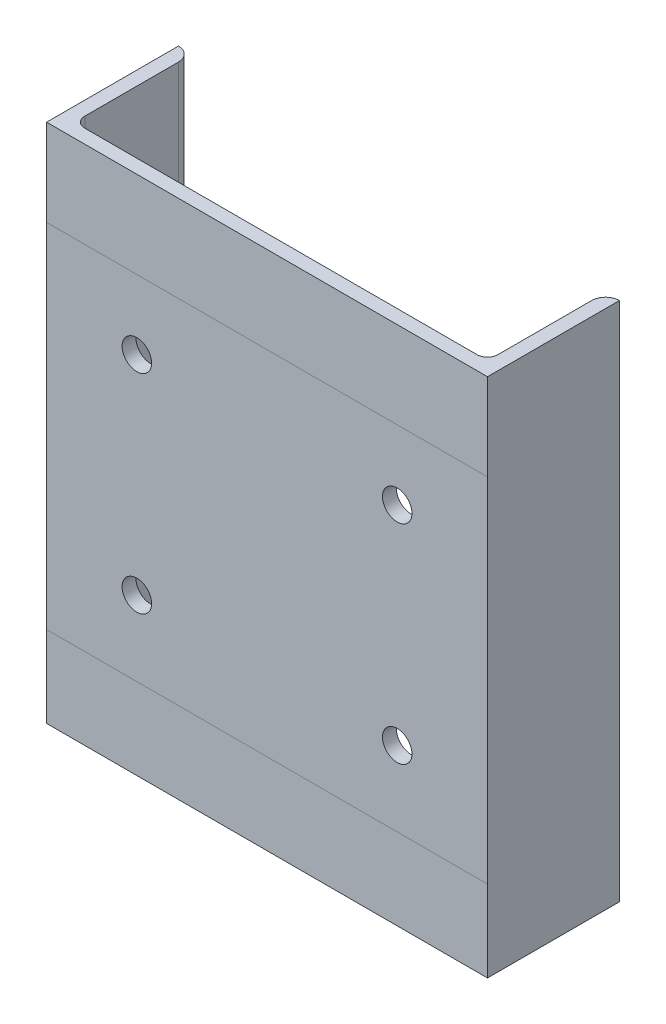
ISO-10303-21;
HEADER;
FILE_DESCRIPTION(('STEP AP214'),'2;1');
FILE_NAME('part.step','',(''),(''),'','','');
FILE_SCHEMA(('AUTOMOTIVE_DESIGN { 1 0 10303 214 1 1 1 1 }'));
ENDSEC;
DATA;
#1=APPLICATION_CONTEXT('core data for automotive mechanical design processes');
#2=APPLICATION_PROTOCOL_DEFINITION('international standard','automotive_design',2000,#1);
#3=PRODUCT_CONTEXT('',#1,'mechanical');
#4=PRODUCT('Part','Part','',(#3));
#5=PRODUCT_RELATED_PRODUCT_CATEGORY('part','',(#4));
#6=PRODUCT_DEFINITION_FORMATION('','',#4);
#7=PRODUCT_DEFINITION_CONTEXT('part definition',#1,'design');
#8=PRODUCT_DEFINITION('design','',#6,#7);
#9=PRODUCT_DEFINITION_SHAPE('','',#8);
#10=(LENGTH_UNIT() NAMED_UNIT(*) SI_UNIT(.MILLI.,.METRE.));
#11=(NAMED_UNIT(*) PLANE_ANGLE_UNIT() SI_UNIT($,.RADIAN.));
#12=(NAMED_UNIT(*) SI_UNIT($,.STERADIAN.) SOLID_ANGLE_UNIT());
#13=UNCERTAINTY_MEASURE_WITH_UNIT(LENGTH_MEASURE(1.E-05),#10,'distance_accuracy_value','');
#14=(GEOMETRIC_REPRESENTATION_CONTEXT(3) GLOBAL_UNCERTAINTY_ASSIGNED_CONTEXT((#13)) GLOBAL_UNIT_ASSIGNED_CONTEXT((#10,
#11,#12)) REPRESENTATION_CONTEXT('',''));
#15=CARTESIAN_POINT('',(0.,0.,0.));
#16=DIRECTION('',(0.,0.,1.));
#17=DIRECTION('',(1.,0.,0.));
#18=AXIS2_PLACEMENT_3D('',#15,#16,#17);
#19=CARTESIAN_POINT('',(-127.,150.,0.));
#20=DIRECTION('',(0.,0.,-1.));
#21=DIRECTION('',(-1.,0.,0.));
#22=AXIS2_PLACEMENT_3D('',#19,#20,#21);
#23=PLANE('',#22);
#24=DIRECTION('',(-1.,0.,0.));
#25=VECTOR('',#24,1.);
#26=CARTESIAN_POINT('',(-127.,100.,0.));
#27=LINE('',#26,#25);
#28=CARTESIAN_POINT('',(127.,100.,0.));
#29=VERTEX_POINT('',#28);
#30=CARTESIAN_POINT('',(-127.,100.,0.));
#31=VERTEX_POINT('',#30);
#32=EDGE_CURVE('E11',#29,#31,#27,.T.);
#33=ORIENTED_EDGE('',*,*,#32,.F.);
#34=DIRECTION('',(0.,-1.,0.));
#35=VECTOR('',#34,1.);
#36=CARTESIAN_POINT('',(127.,150.,0.));
#37=LINE('',#36,#35);
#38=CARTESIAN_POINT('',(127.,150.,0.));
#39=VERTEX_POINT('',#38);
#40=EDGE_CURVE('E126',#39,#29,#37,.T.);
#41=ORIENTED_EDGE('',*,*,#40,.F.);
#42=DIRECTION('',(1.,0.,0.));
#43=VECTOR('',#42,1.);
#44=CARTESIAN_POINT('',(-127.,150.,0.));
#45=LINE('',#44,#43);
#46=CARTESIAN_POINT('',(-127.,150.,0.));
#47=VERTEX_POINT('',#46);
#48=EDGE_CURVE('E121',#47,#39,#45,.T.);
#49=ORIENTED_EDGE('',*,*,#48,.F.);
#50=DIRECTION('',(0.,-1.,0.));
#51=VECTOR('',#50,1.);
#52=CARTESIAN_POINT('',(-127.,150.,0.));
#53=LINE('',#52,#51);
#54=EDGE_CURVE('E124',#47,#31,#53,.T.);
#55=ORIENTED_EDGE('',*,*,#54,.T.);
#56=EDGE_LOOP('',(#33,#41,#49,#55));
#57=FACE_BOUND('',#56,.T.);
#58=ADVANCED_FACE('F33',(#57),#23,.F.);
#59=DIRECTION('',(1.,0.,0.));
#60=VECTOR('',#59,1.);
#61=CARTESIAN_POINT('',(-127.,-103.126399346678,0.));
#62=LINE('',#61,#60);
#63=CARTESIAN_POINT('',(-127.,-103.126399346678,0.));
#64=VERTEX_POINT('',#63);
#65=CARTESIAN_POINT('',(127.,-103.126399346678,0.));
#66=VERTEX_POINT('',#65);
#67=EDGE_CURVE('E42',#64,#66,#62,.T.);
#68=ORIENTED_EDGE('',*,*,#67,.F.);
#69=CARTESIAN_POINT('',(-127.,-150.,0.));
#70=VERTEX_POINT('',#69);
#71=EDGE_CURVE('E144',#64,#70,#53,.T.);
#72=ORIENTED_EDGE('',*,*,#71,.T.);
#73=DIRECTION('',(1.,0.,0.));
#74=VECTOR('',#73,1.);
#75=CARTESIAN_POINT('',(-127.,-150.,0.));
#76=LINE('',#75,#74);
#77=CARTESIAN_POINT('',(127.,-150.,0.));
#78=VERTEX_POINT('',#77);
#79=EDGE_CURVE('E196',#70,#78,#76,.T.);
#80=ORIENTED_EDGE('',*,*,#79,.T.);
#81=EDGE_CURVE('E150',#66,#78,#37,.T.);
#82=ORIENTED_EDGE('',*,*,#81,.F.);
#83=EDGE_LOOP('',(#68,#72,#80,#82));
#84=FACE_BOUND('',#83,.T.);
#85=ADVANCED_FACE('F246',(#84),#23,.F.);
#86=CARTESIAN_POINT('',(-127.,150.,0.));
#87=DIRECTION('',(1.,0.,0.));
#88=DIRECTION('',(0.,0.,-1.));
#89=AXIS2_PLACEMENT_3D('',#86,#87,#88);
#90=PLANE('',#89);
#91=DIRECTION('',(0.,0.,1.));
#92=VECTOR('',#91,1.);
#93=CARTESIAN_POINT('',(-127.,-150.,0.));
#94=LINE('',#93,#92);
#95=CARTESIAN_POINT('',(-127.,-150.,-76.));
#96=VERTEX_POINT('',#95);
#97=EDGE_CURVE('E198',#96,#70,#94,.T.);
#98=ORIENTED_EDGE('',*,*,#97,.T.);
#99=ORIENTED_EDGE('',*,*,#71,.F.);
#100=EDGE_CURVE('E142',#31,#64,#53,.T.);
#101=ORIENTED_EDGE('',*,*,#100,.F.);
#102=ORIENTED_EDGE('',*,*,#54,.F.);
#103=DIRECTION('',(0.,0.,1.));
#104=VECTOR('',#103,1.);
#105=CARTESIAN_POINT('',(-127.,150.,0.));
#106=LINE('',#105,#104);
#107=CARTESIAN_POINT('',(-127.,150.,-76.));
#108=VERTEX_POINT('',#107);
#109=EDGE_CURVE('E130',#108,#47,#106,.T.);
#110=ORIENTED_EDGE('',*,*,#109,.F.);
#111=DIRECTION('',(0.,-1.,0.));
#112=VECTOR('',#111,1.);
#113=CARTESIAN_POINT('',(-127.,150.,-76.));
#114=LINE('',#113,#112);
#115=EDGE_CURVE('E179',#108,#96,#114,.T.);
#116=ORIENTED_EDGE('',*,*,#115,.T.);
#117=EDGE_LOOP('',(#98,#99,#101,#102,#110,#116));
#118=FACE_BOUND('',#117,.T.);
#119=ADVANCED_FACE('F35',(#118),#90,.F.);
#120=CARTESIAN_POINT('',(75.,-60.,0.));
#121=DIRECTION('',(0.,0.,1.));
#122=DIRECTION('',(1.,0.,0.));
#123=AXIS2_PLACEMENT_3D('',#120,#121,#122);
#124=CIRCLE('',#123,8.50000000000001);
#125=CARTESIAN_POINT('',(83.5,-60.,0.));
#126=VERTEX_POINT('',#125);
#127=EDGE_CURVE('E235',#126,#126,#124,.T.);
#128=ORIENTED_EDGE('',*,*,#127,.F.);
#129=EDGE_LOOP('',(#128));
#130=FACE_BOUND('',#129,.T.);
#131=CARTESIAN_POINT('',(-75.,-60.,0.));
#132=DIRECTION('',(0.,0.,1.));
#133=DIRECTION('',(1.,0.,0.));
#134=AXIS2_PLACEMENT_3D('',#131,#132,#133);
#135=CIRCLE('',#134,8.5);
#136=CARTESIAN_POINT('',(-66.5,-60.,0.));
#137=VERTEX_POINT('',#136);
#138=EDGE_CURVE('E229',#137,#137,#135,.T.);
#139=ORIENTED_EDGE('',*,*,#138,.F.);
#140=EDGE_LOOP('',(#139));
#141=FACE_BOUND('',#140,.T.);
#142=CARTESIAN_POINT('',(-75.,60.,0.));
#143=DIRECTION('',(0.,0.,1.));
#144=DIRECTION('',(1.,0.,0.));
#145=AXIS2_PLACEMENT_3D('',#142,#143,#144);
#146=CIRCLE('',#145,8.5);
#147=CARTESIAN_POINT('',(-66.5,60.,0.));
#148=VERTEX_POINT('',#147);
#149=EDGE_CURVE('E223',#148,#148,#146,.T.);
#150=ORIENTED_EDGE('',*,*,#149,.F.);
#151=EDGE_LOOP('',(#150));
#152=FACE_BOUND('',#151,.T.);
#153=CARTESIAN_POINT('',(75.,60.,0.));
#154=DIRECTION('',(0.,0.,1.));
#155=DIRECTION('',(1.,0.,0.));
#156=AXIS2_PLACEMENT_3D('',#153,#154,#155);
#157=CIRCLE('',#156,8.50000000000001);
#158=CARTESIAN_POINT('',(83.5,60.,0.));
#159=VERTEX_POINT('',#158);
#160=EDGE_CURVE('E217',#159,#159,#157,.T.);
#161=ORIENTED_EDGE('',*,*,#160,.F.);
#162=EDGE_LOOP('',(#161));
#163=FACE_BOUND('',#162,.T.);
#164=EDGE_CURVE('E149',#29,#66,#37,.T.);
#165=ORIENTED_EDGE('',*,*,#164,.F.);
#166=ORIENTED_EDGE('',*,*,#32,.T.);
#167=ORIENTED_EDGE('',*,*,#100,.T.);
#168=ORIENTED_EDGE('',*,*,#67,.T.);
#169=EDGE_LOOP('',(#165,#166,#167,#168));
#170=FACE_BOUND('',#169,.T.);
#171=ADVANCED_FACE('F242',(#130,#141,#152,#163,#170),#23,.F.);
#172=CARTESIAN_POINT('',(127.,150.,0.));
#173=DIRECTION('',(-1.,0.,0.));
#174=DIRECTION('',(0.,0.,1.));
#175=AXIS2_PLACEMENT_3D('',#172,#173,#174);
#176=PLANE('',#175);
#177=DIRECTION('',(0.,0.,-1.));
#178=VECTOR('',#177,1.);
#179=CARTESIAN_POINT('',(127.,-150.,0.));
#180=LINE('',#179,#178);
#181=CARTESIAN_POINT('',(127.,-150.,-76.));
#182=VERTEX_POINT('',#181);
#183=EDGE_CURVE('E194',#78,#182,#180,.T.);
#184=ORIENTED_EDGE('',*,*,#183,.T.);
#185=DIRECTION('',(0.,-1.,0.));
#186=VECTOR('',#185,1.);
#187=CARTESIAN_POINT('',(127.,150.,-76.));
#188=LINE('',#187,#186);
#189=CARTESIAN_POINT('',(127.,150.,-76.));
#190=VERTEX_POINT('',#189);
#191=EDGE_CURVE('E154',#190,#182,#188,.T.);
#192=ORIENTED_EDGE('',*,*,#191,.F.);
#193=DIRECTION('',(0.,0.,-1.));
#194=VECTOR('',#193,1.);
#195=CARTESIAN_POINT('',(127.,150.,0.));
#196=LINE('',#195,#194);
#197=EDGE_CURVE('E129',#39,#190,#196,.T.);
#198=ORIENTED_EDGE('',*,*,#197,.F.);
#199=ORIENTED_EDGE('',*,*,#40,.T.);
#200=ORIENTED_EDGE('',*,*,#164,.T.);
#201=ORIENTED_EDGE('',*,*,#81,.T.);
#202=EDGE_LOOP('',(#184,#192,#198,#199,#200,#201));
#203=FACE_BOUND('',#202,.T.);
#204=ADVANCED_FACE('F245',(#203),#176,.F.);
#205=CARTESIAN_POINT('',(127.,150.,-68.));
#206=DIRECTION('',(0.,-1.,0.));
#207=DIRECTION('',(0.,0.,-1.));
#208=AXIS2_PLACEMENT_3D('',#205,#206,#207);
#209=CYLINDRICAL_SURFACE('',#208,8.);
#210=CARTESIAN_POINT('',(127.,-150.,-68.));
#211=DIRECTION('',(0.,1.,0.));
#212=DIRECTION('',(0.,0.,-1.));
#213=AXIS2_PLACEMENT_3D('',#210,#211,#212);
#214=CIRCLE('',#213,8.);
#215=CARTESIAN_POINT('',(119.,-150.,-68.));
#216=VERTEX_POINT('',#215);
#217=EDGE_CURVE('E192',#182,#216,#214,.T.);
#218=ORIENTED_EDGE('',*,*,#217,.T.);
#219=DIRECTION('',(0.,-1.,0.));
#220=VECTOR('',#219,1.);
#221=CARTESIAN_POINT('',(119.,150.,-68.));
#222=LINE('',#221,#220);
#223=CARTESIAN_POINT('',(119.,150.,-68.));
#224=VERTEX_POINT('',#223);
#225=EDGE_CURVE('E156',#224,#216,#222,.T.);
#226=ORIENTED_EDGE('',*,*,#225,.F.);
#227=CARTESIAN_POINT('',(127.,150.,-68.));
#228=DIRECTION('',(0.,1.,0.));
#229=DIRECTION('',(0.,0.,-1.));
#230=AXIS2_PLACEMENT_3D('',#227,#228,#229);
#231=CIRCLE('',#230,8.);
#232=EDGE_CURVE('E212',#190,#224,#231,.T.);
#233=ORIENTED_EDGE('',*,*,#232,.F.);
#234=ORIENTED_EDGE('',*,*,#191,.T.);
#235=EDGE_LOOP('',(#218,#226,#233,#234));
#236=FACE_BOUND('',#235,.T.);
#237=ADVANCED_FACE('F254',(#236),#209,.T.);
#238=CARTESIAN_POINT('',(119.,150.,-14.));
#239=DIRECTION('',(1.,0.,0.));
#240=DIRECTION('',(0.,0.,-1.));
#241=AXIS2_PLACEMENT_3D('',#238,#239,#240);
#242=PLANE('',#241);
#243=DIRECTION('',(0.,0.,1.));
#244=VECTOR('',#243,1.);
#245=CARTESIAN_POINT('',(119.,-150.,-14.));
#246=LINE('',#245,#244);
#247=CARTESIAN_POINT('',(119.,-150.,-14.));
#248=VERTEX_POINT('',#247);
#249=EDGE_CURVE('E190',#216,#248,#246,.T.);
#250=ORIENTED_EDGE('',*,*,#249,.T.);
#251=DIRECTION('',(0.,-1.,0.));
#252=VECTOR('',#251,1.);
#253=CARTESIAN_POINT('',(119.,150.,-14.));
#254=LINE('',#253,#252);
#255=CARTESIAN_POINT('',(119.,150.,-14.));
#256=VERTEX_POINT('',#255);
#257=EDGE_CURVE('E162',#256,#248,#254,.T.);
#258=ORIENTED_EDGE('',*,*,#257,.F.);
#259=DIRECTION('',(0.,0.,1.));
#260=VECTOR('',#259,1.);
#261=CARTESIAN_POINT('',(119.,150.,-14.));
#262=LINE('',#261,#260);
#263=EDGE_CURVE('E210',#224,#256,#262,.T.);
#264=ORIENTED_EDGE('',*,*,#263,.F.);
#265=ORIENTED_EDGE('',*,*,#225,.T.);
#266=EDGE_LOOP('',(#250,#258,#264,#265));
#267=FACE_BOUND('',#266,.T.);
#268=ADVANCED_FACE('F259',(#267),#242,.F.);
#269=CARTESIAN_POINT('',(113.,150.,-14.));
#270=DIRECTION('',(0.,-1.,0.));
#271=DIRECTION('',(0.,0.,-1.));
#272=AXIS2_PLACEMENT_3D('',#269,#270,#271);
#273=CYLINDRICAL_SURFACE('',#272,6.);
#274=CARTESIAN_POINT('',(113.,-150.,-14.));
#275=DIRECTION('',(0.,-1.,0.));
#276=DIRECTION('',(0.,0.,1.));
#277=AXIS2_PLACEMENT_3D('',#274,#275,#276);
#278=CIRCLE('',#277,6.);
#279=CARTESIAN_POINT('',(113.,-150.,-8.));
#280=VERTEX_POINT('',#279);
#281=EDGE_CURVE('E188',#248,#280,#278,.T.);
#282=ORIENTED_EDGE('',*,*,#281,.T.);
#283=DIRECTION('',(0.,-1.,0.));
#284=VECTOR('',#283,1.);
#285=CARTESIAN_POINT('',(113.,150.,-8.));
#286=LINE('',#285,#284);
#287=CARTESIAN_POINT('',(113.,150.,-8.));
#288=VERTEX_POINT('',#287);
#289=EDGE_CURVE('E167',#288,#280,#286,.T.);
#290=ORIENTED_EDGE('',*,*,#289,.F.);
#291=CARTESIAN_POINT('',(113.,150.,-14.));
#292=DIRECTION('',(0.,-1.,0.));
#293=DIRECTION('',(0.,0.,1.));
#294=AXIS2_PLACEMENT_3D('',#291,#292,#293);
#295=CIRCLE('',#294,6.);
#296=EDGE_CURVE('E208',#256,#288,#295,.T.);
#297=ORIENTED_EDGE('',*,*,#296,.F.);
#298=ORIENTED_EDGE('',*,*,#257,.T.);
#299=EDGE_LOOP('',(#282,#290,#297,#298));
#300=FACE_BOUND('',#299,.T.);
#301=ADVANCED_FACE('F296',(#300),#273,.F.);
#302=CARTESIAN_POINT('',(-113.,150.,-8.));
#303=DIRECTION('',(0.,0.,1.));
#304=DIRECTION('',(1.,0.,0.));
#305=AXIS2_PLACEMENT_3D('',#302,#303,#304);
#306=PLANE('',#305);
#307=CARTESIAN_POINT('',(75.,-60.,-8.00000000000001));
#308=DIRECTION('',(0.,0.,1.));
#309=DIRECTION('',(1.,0.,0.));
#310=AXIS2_PLACEMENT_3D('',#307,#308,#309);
#311=CIRCLE('',#310,8.50000000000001);
#312=CARTESIAN_POINT('',(83.5,-60.,-8.00000000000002));
#313=VERTEX_POINT('',#312);
#314=EDGE_CURVE('E232',#313,#313,#311,.F.);
#315=ORIENTED_EDGE('',*,*,#314,.F.);
#316=EDGE_LOOP('',(#315));
#317=FACE_BOUND('',#316,.T.);
#318=CARTESIAN_POINT('',(-75.,-60.,-8.00000000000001));
#319=DIRECTION('',(0.,0.,1.));
#320=DIRECTION('',(1.,0.,0.));
#321=AXIS2_PLACEMENT_3D('',#318,#319,#320);
#322=CIRCLE('',#321,8.5);
#323=CARTESIAN_POINT('',(-66.5,-60.,-8.00000000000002));
#324=VERTEX_POINT('',#323);
#325=EDGE_CURVE('E226',#324,#324,#322,.F.);
#326=ORIENTED_EDGE('',*,*,#325,.F.);
#327=EDGE_LOOP('',(#326));
#328=FACE_BOUND('',#327,.T.);
#329=CARTESIAN_POINT('',(-75.,60.,-8.00000000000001));
#330=DIRECTION('',(0.,0.,1.));
#331=DIRECTION('',(1.,0.,0.));
#332=AXIS2_PLACEMENT_3D('',#329,#330,#331);
#333=CIRCLE('',#332,8.5);
#334=CARTESIAN_POINT('',(-66.5,60.,-8.00000000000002));
#335=VERTEX_POINT('',#334);
#336=EDGE_CURVE('E220',#335,#335,#333,.F.);
#337=ORIENTED_EDGE('',*,*,#336,.F.);
#338=EDGE_LOOP('',(#337));
#339=FACE_BOUND('',#338,.T.);
#340=CARTESIAN_POINT('',(75.,60.,-8.00000000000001));
#341=DIRECTION('',(0.,0.,1.));
#342=DIRECTION('',(1.,0.,0.));
#343=AXIS2_PLACEMENT_3D('',#340,#341,#342);
#344=CIRCLE('',#343,8.50000000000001);
#345=CARTESIAN_POINT('',(83.5,60.,-8.00000000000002));
#346=VERTEX_POINT('',#345);
#347=EDGE_CURVE('E200',#346,#346,#344,.F.);
#348=ORIENTED_EDGE('',*,*,#347,.F.);
#349=EDGE_LOOP('',(#348));
#350=FACE_BOUND('',#349,.T.);
#351=DIRECTION('',(-1.,0.,0.));
#352=VECTOR('',#351,1.);
#353=CARTESIAN_POINT('',(-113.,-150.,-8.));
#354=LINE('',#353,#352);
#355=CARTESIAN_POINT('',(-113.,-150.,-8.));
#356=VERTEX_POINT('',#355);
#357=EDGE_CURVE('E186',#280,#356,#354,.T.);
#358=ORIENTED_EDGE('',*,*,#357,.T.);
#359=DIRECTION('',(0.,-1.,0.));
#360=VECTOR('',#359,1.);
#361=CARTESIAN_POINT('',(-113.,150.,-8.));
#362=LINE('',#361,#360);
#363=CARTESIAN_POINT('',(-113.,150.,-8.));
#364=VERTEX_POINT('',#363);
#365=EDGE_CURVE('E170',#364,#356,#362,.T.);
#366=ORIENTED_EDGE('',*,*,#365,.F.);
#367=DIRECTION('',(-1.,0.,0.));
#368=VECTOR('',#367,1.);
#369=CARTESIAN_POINT('',(-113.,150.,-8.));
#370=LINE('',#369,#368);
#371=EDGE_CURVE('E206',#288,#364,#370,.T.);
#372=ORIENTED_EDGE('',*,*,#371,.F.);
#373=ORIENTED_EDGE('',*,*,#289,.T.);
#374=EDGE_LOOP('',(#358,#366,#372,#373));
#375=FACE_BOUND('',#374,.T.);
#376=ADVANCED_FACE('F305',(#317,#328,#339,#350,#375),#306,.F.);
#377=CARTESIAN_POINT('',(-113.,150.,-14.));
#378=DIRECTION('',(0.,-1.,0.));
#379=DIRECTION('',(0.,0.,-1.));
#380=AXIS2_PLACEMENT_3D('',#377,#378,#379);
#381=CYLINDRICAL_SURFACE('',#380,6.);
#382=CARTESIAN_POINT('',(-113.,-150.,-14.));
#383=DIRECTION('',(0.,-1.,0.));
#384=DIRECTION('',(0.,0.,-1.));
#385=AXIS2_PLACEMENT_3D('',#382,#383,#384);
#386=CIRCLE('',#385,6.);
#387=CARTESIAN_POINT('',(-119.,-150.,-14.));
#388=VERTEX_POINT('',#387);
#389=EDGE_CURVE('E184',#356,#388,#386,.T.);
#390=ORIENTED_EDGE('',*,*,#389,.T.);
#391=DIRECTION('',(0.,-1.,0.));
#392=VECTOR('',#391,1.);
#393=CARTESIAN_POINT('',(-119.,150.,-14.));
#394=LINE('',#393,#392);
#395=CARTESIAN_POINT('',(-119.,150.,-14.));
#396=VERTEX_POINT('',#395);
#397=EDGE_CURVE('E173',#396,#388,#394,.T.);
#398=ORIENTED_EDGE('',*,*,#397,.F.);
#399=CARTESIAN_POINT('',(-113.,150.,-14.));
#400=DIRECTION('',(0.,-1.,0.));
#401=DIRECTION('',(0.,0.,-1.));
#402=AXIS2_PLACEMENT_3D('',#399,#400,#401);
#403=CIRCLE('',#402,6.);
#404=EDGE_CURVE('E204',#364,#396,#403,.T.);
#405=ORIENTED_EDGE('',*,*,#404,.F.);
#406=ORIENTED_EDGE('',*,*,#365,.T.);
#407=EDGE_LOOP('',(#390,#398,#405,#406));
#408=FACE_BOUND('',#407,.T.);
#409=ADVANCED_FACE('F315',(#408),#381,.F.);
#410=CARTESIAN_POINT('',(-119.,150.,-14.));
#411=DIRECTION('',(-1.,0.,0.));
#412=DIRECTION('',(0.,0.,1.));
#413=AXIS2_PLACEMENT_3D('',#410,#411,#412);
#414=PLANE('',#413);
#415=DIRECTION('',(0.,0.,-1.));
#416=VECTOR('',#415,1.);
#417=CARTESIAN_POINT('',(-119.,-150.,-14.));
#418=LINE('',#417,#416);
#419=CARTESIAN_POINT('',(-119.,-150.,-68.));
#420=VERTEX_POINT('',#419);
#421=EDGE_CURVE('E182',#388,#420,#418,.T.);
#422=ORIENTED_EDGE('',*,*,#421,.T.);
#423=DIRECTION('',(0.,-1.,0.));
#424=VECTOR('',#423,1.);
#425=CARTESIAN_POINT('',(-119.,150.,-68.));
#426=LINE('',#425,#424);
#427=CARTESIAN_POINT('',(-119.,150.,-68.));
#428=VERTEX_POINT('',#427);
#429=EDGE_CURVE('E176',#428,#420,#426,.T.);
#430=ORIENTED_EDGE('',*,*,#429,.F.);
#431=DIRECTION('',(0.,0.,-1.));
#432=VECTOR('',#431,1.);
#433=CARTESIAN_POINT('',(-119.,150.,-14.));
#434=LINE('',#433,#432);
#435=EDGE_CURVE('E202',#396,#428,#434,.T.);
#436=ORIENTED_EDGE('',*,*,#435,.F.);
#437=ORIENTED_EDGE('',*,*,#397,.T.);
#438=EDGE_LOOP('',(#422,#430,#436,#437));
#439=FACE_BOUND('',#438,.T.);
#440=ADVANCED_FACE('F325',(#439),#414,.F.);
#441=CARTESIAN_POINT('',(-127.,150.,-68.));
#442=DIRECTION('',(0.,-1.,0.));
#443=DIRECTION('',(0.,0.,-1.));
#444=AXIS2_PLACEMENT_3D('',#441,#442,#443);
#445=CYLINDRICAL_SURFACE('',#444,8.);
#446=CARTESIAN_POINT('',(-127.,-150.,-68.));
#447=DIRECTION('',(0.,1.,0.));
#448=DIRECTION('',(0.,0.,1.));
#449=AXIS2_PLACEMENT_3D('',#446,#447,#448);
#450=CIRCLE('',#449,8.);
#451=EDGE_CURVE('E139',#420,#96,#450,.T.);
#452=ORIENTED_EDGE('',*,*,#451,.T.);
#453=ORIENTED_EDGE('',*,*,#115,.F.);
#454=CARTESIAN_POINT('',(-127.,150.,-68.));
#455=DIRECTION('',(0.,1.,0.));
#456=DIRECTION('',(0.,0.,1.));
#457=AXIS2_PLACEMENT_3D('',#454,#455,#456);
#458=CIRCLE('',#457,8.);
#459=EDGE_CURVE('E135',#428,#108,#458,.T.);
#460=ORIENTED_EDGE('',*,*,#459,.F.);
#461=ORIENTED_EDGE('',*,*,#429,.T.);
#462=EDGE_LOOP('',(#452,#453,#460,#461));
#463=FACE_BOUND('',#462,.T.);
#464=ADVANCED_FACE('F334',(#463),#445,.T.);
#465=CARTESIAN_POINT('',(-127.,150.,-68.));
#466=DIRECTION('',(0.,1.,0.));
#467=DIRECTION('',(0.,0.,1.));
#468=AXIS2_PLACEMENT_3D('',#465,#466,#467);
#469=PLANE('',#468);
#470=ORIENTED_EDGE('',*,*,#109,.T.);
#471=ORIENTED_EDGE('',*,*,#48,.T.);
#472=ORIENTED_EDGE('',*,*,#197,.T.);
#473=ORIENTED_EDGE('',*,*,#232,.T.);
#474=ORIENTED_EDGE('',*,*,#263,.T.);
#475=ORIENTED_EDGE('',*,*,#296,.T.);
#476=ORIENTED_EDGE('',*,*,#371,.T.);
#477=ORIENTED_EDGE('',*,*,#404,.T.);
#478=ORIENTED_EDGE('',*,*,#435,.T.);
#479=ORIENTED_EDGE('',*,*,#459,.T.);
#480=EDGE_LOOP('',(#470,#471,#472,#473,#474,#475,#476,#477,#478,#479));
#481=FACE_BOUND('',#480,.T.);
#482=ADVANCED_FACE('F133',(#481),#469,.T.);
#483=CARTESIAN_POINT('',(-127.,-150.,-68.));
#484=DIRECTION('',(0.,1.,0.));
#485=DIRECTION('',(0.,0.,1.));
#486=AXIS2_PLACEMENT_3D('',#483,#484,#485);
#487=PLANE('',#486);
#488=ORIENTED_EDGE('',*,*,#97,.F.);
#489=ORIENTED_EDGE('',*,*,#451,.F.);
#490=ORIENTED_EDGE('',*,*,#421,.F.);
#491=ORIENTED_EDGE('',*,*,#389,.F.);
#492=ORIENTED_EDGE('',*,*,#357,.F.);
#493=ORIENTED_EDGE('',*,*,#281,.F.);
#494=ORIENTED_EDGE('',*,*,#249,.F.);
#495=ORIENTED_EDGE('',*,*,#217,.F.);
#496=ORIENTED_EDGE('',*,*,#183,.F.);
#497=ORIENTED_EDGE('',*,*,#79,.F.);
#498=EDGE_LOOP('',(#488,#489,#490,#491,#492,#493,#494,#495,#496,#497));
#499=FACE_BOUND('',#498,.T.);
#500=ADVANCED_FACE('F351',(#499),#487,.F.);
#501=CARTESIAN_POINT('',(75.,60.,-76.001));
#502=DIRECTION('',(0.,0.,1.));
#503=DIRECTION('',(1.,0.,0.));
#504=AXIS2_PLACEMENT_3D('',#501,#502,#503);
#505=CYLINDRICAL_SURFACE('',#504,8.50000000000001);
#506=CARTESIAN_POINT('',(83.5,60.,0.));
#507=CARTESIAN_POINT('',(83.5,60.,-0.0833333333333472));
#508=CARTESIAN_POINT('',(83.5,60.,-0.166666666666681));
#509=CARTESIAN_POINT('',(83.5,60.,-0.333333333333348));
#510=CARTESIAN_POINT('',(83.5,60.,-0.416666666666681));
#511=CARTESIAN_POINT('',(83.5,60.,-0.583333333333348));
#512=CARTESIAN_POINT('',(83.5,60.,-0.666666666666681));
#513=CARTESIAN_POINT('',(83.5,60.,-0.833333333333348));
#514=CARTESIAN_POINT('',(83.5,60.,-0.916666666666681));
#515=CARTESIAN_POINT('',(83.5,60.,-1.08333333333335));
#516=CARTESIAN_POINT('',(83.5,60.,-1.16666666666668));
#517=CARTESIAN_POINT('',(83.5,60.,-1.33333333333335));
#518=CARTESIAN_POINT('',(83.5,60.,-1.41666666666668));
#519=CARTESIAN_POINT('',(83.5,60.,-1.58333333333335));
#520=CARTESIAN_POINT('',(83.5,60.,-1.66666666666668));
#521=CARTESIAN_POINT('',(83.5,60.,-1.83333333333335));
#522=CARTESIAN_POINT('',(83.5,60.,-1.91666666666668));
#523=CARTESIAN_POINT('',(83.5,60.,-2.08333333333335));
#524=CARTESIAN_POINT('',(83.5,60.,-2.16666666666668));
#525=CARTESIAN_POINT('',(83.5,60.,-2.33333333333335));
#526=CARTESIAN_POINT('',(83.5,60.,-2.41666666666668));
#527=CARTESIAN_POINT('',(83.5,60.,-2.58333333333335));
#528=CARTESIAN_POINT('',(83.5,60.,-2.66666666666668));
#529=CARTESIAN_POINT('',(83.5,60.,-2.83333333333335));
#530=CARTESIAN_POINT('',(83.5,60.,-2.91666666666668));
#531=CARTESIAN_POINT('',(83.5,60.,-3.08333333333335));
#532=CARTESIAN_POINT('',(83.5,60.,-3.16666666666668));
#533=CARTESIAN_POINT('',(83.5,60.,-3.33333333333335));
#534=CARTESIAN_POINT('',(83.5,60.,-3.41666666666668));
#535=CARTESIAN_POINT('',(83.5,60.,-3.58333333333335));
#536=CARTESIAN_POINT('',(83.5,60.,-3.66666666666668));
#537=CARTESIAN_POINT('',(83.5,60.,-3.83333333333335));
#538=CARTESIAN_POINT('',(83.5,60.,-3.91666666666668));
#539=CARTESIAN_POINT('',(83.5,60.,-4.08333333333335));
#540=CARTESIAN_POINT('',(83.5,60.,-4.16666666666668));
#541=CARTESIAN_POINT('',(83.5,60.,-4.33333333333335));
#542=CARTESIAN_POINT('',(83.5,60.,-4.41666666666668));
#543=CARTESIAN_POINT('',(83.5,60.,-4.58333333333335));
#544=CARTESIAN_POINT('',(83.5,60.,-4.66666666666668));
#545=CARTESIAN_POINT('',(83.5,60.,-4.83333333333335));
#546=CARTESIAN_POINT('',(83.5,60.,-4.91666666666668));
#547=CARTESIAN_POINT('',(83.5,60.,-5.08333333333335));
#548=CARTESIAN_POINT('',(83.5,60.,-5.16666666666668));
#549=CARTESIAN_POINT('',(83.5,60.,-5.33333333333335));
#550=CARTESIAN_POINT('',(83.5,60.,-5.41666666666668));
#551=CARTESIAN_POINT('',(83.5,60.,-5.58333333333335));
#552=CARTESIAN_POINT('',(83.5,60.,-5.66666666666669));
#553=CARTESIAN_POINT('',(83.5,60.,-5.83333333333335));
#554=CARTESIAN_POINT('',(83.5,60.,-5.91666666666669));
#555=CARTESIAN_POINT('',(83.5,60.,-6.08333333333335));
#556=CARTESIAN_POINT('',(83.5,60.,-6.16666666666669));
#557=CARTESIAN_POINT('',(83.5,60.,-6.33333333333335));
#558=CARTESIAN_POINT('',(83.5,60.,-6.41666666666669));
#559=CARTESIAN_POINT('',(83.5,60.,-6.58333333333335));
#560=CARTESIAN_POINT('',(83.5,60.,-6.66666666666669));
#561=CARTESIAN_POINT('',(83.5,60.,-6.83333333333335));
#562=CARTESIAN_POINT('',(83.5,60.,-6.91666666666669));
#563=CARTESIAN_POINT('',(83.5,60.,-7.08333333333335));
#564=CARTESIAN_POINT('',(83.5,60.,-7.16666666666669));
#565=CARTESIAN_POINT('',(83.5,60.,-7.33333333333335));
#566=CARTESIAN_POINT('',(83.5,60.,-7.41666666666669));
#567=CARTESIAN_POINT('',(83.5,60.,-7.58333333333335));
#568=CARTESIAN_POINT('',(83.5,60.,-7.66666666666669));
#569=CARTESIAN_POINT('',(83.5,60.,-7.83333333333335));
#570=CARTESIAN_POINT('',(83.5,60.,-7.91666666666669));
#571=CARTESIAN_POINT('',(83.5,60.,-8.00000000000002));
#572=B_SPLINE_CURVE_WITH_KNOTS('',3,(#506,#507,#508,#509,#510,#511,#512,#513,#514,#515,#516,
#517,#518,#519,#520,#521,#522,#523,#524,#525,#526,#527,#528,#529,#530,#531,#532,#533,#534,#535,
#536,#537,#538,#539,#540,#541,#542,#543,#544,#545,#546,#547,#548,#549,#550,#551,#552,#553,#554,
#555,#556,#557,#558,#559,#560,#561,#562,#563,#564,#565,#566,#567,#568,#569,#570,#571),
.UNSPECIFIED.,.F.,.F.,(4,2,2,2,2,2,2,2,2,2,2,2,2,2,2,2,2,2,2,2,2,2,2,2,2,2,2,2,2,2,2,2,4),(0.,
0.25,0.5,0.750000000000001,1.,1.25,1.5,1.75,2.,2.25,2.5,2.75,3.,3.25,3.5,3.75,4.,4.25,4.5,4.75,
5.,5.25,5.50000000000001,5.75000000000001,6.00000000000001,6.25000000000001,6.50000000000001,
6.75000000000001,7.00000000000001,7.25000000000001,7.50000000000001,7.75000000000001,
8.00000000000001),.UNSPECIFIED.);
#573=EDGE_CURVE('BSEAM358',#159,#346,#572,.T.);
#574=ORIENTED_EDGE('',*,*,#160,.T.);
#575=ORIENTED_EDGE('',*,*,#347,.T.);
#576=ORIENTED_EDGE('',*,*,#573,.T.);
#577=ORIENTED_EDGE('',*,*,#573,.F.);
#578=EDGE_LOOP('',(#574,#576,#575,#577));
#579=FACE_BOUND('',#578,.T.);
#580=ADVANCED_FACE('F358',(#579),#505,.F.);
#581=CARTESIAN_POINT('',(-75.,60.,-76.001));
#582=DIRECTION('',(0.,0.,1.));
#583=DIRECTION('',(1.,0.,0.));
#584=AXIS2_PLACEMENT_3D('',#581,#582,#583);
#585=CYLINDRICAL_SURFACE('',#584,8.5);
#586=CARTESIAN_POINT('',(-66.5,60.,0.));
#587=CARTESIAN_POINT('',(-66.5,60.,-0.0833333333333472));
#588=CARTESIAN_POINT('',(-66.5,60.,-0.166666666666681));
#589=CARTESIAN_POINT('',(-66.5,60.,-0.333333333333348));
#590=CARTESIAN_POINT('',(-66.5,60.,-0.416666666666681));
#591=CARTESIAN_POINT('',(-66.5,60.,-0.583333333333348));
#592=CARTESIAN_POINT('',(-66.5,60.,-0.666666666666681));
#593=CARTESIAN_POINT('',(-66.5,60.,-0.833333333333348));
#594=CARTESIAN_POINT('',(-66.5,60.,-0.916666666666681));
#595=CARTESIAN_POINT('',(-66.5,60.,-1.08333333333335));
#596=CARTESIAN_POINT('',(-66.5,60.,-1.16666666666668));
#597=CARTESIAN_POINT('',(-66.5,60.,-1.33333333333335));
#598=CARTESIAN_POINT('',(-66.5,60.,-1.41666666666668));
#599=CARTESIAN_POINT('',(-66.5,60.,-1.58333333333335));
#600=CARTESIAN_POINT('',(-66.5,60.,-1.66666666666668));
#601=CARTESIAN_POINT('',(-66.5,60.,-1.83333333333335));
#602=CARTESIAN_POINT('',(-66.5,60.,-1.91666666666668));
#603=CARTESIAN_POINT('',(-66.5,60.,-2.08333333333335));
#604=CARTESIAN_POINT('',(-66.5,60.,-2.16666666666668));
#605=CARTESIAN_POINT('',(-66.5,60.,-2.33333333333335));
#606=CARTESIAN_POINT('',(-66.5,60.,-2.41666666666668));
#607=CARTESIAN_POINT('',(-66.5,60.,-2.58333333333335));
#608=CARTESIAN_POINT('',(-66.5,60.,-2.66666666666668));
#609=CARTESIAN_POINT('',(-66.5,60.,-2.83333333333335));
#610=CARTESIAN_POINT('',(-66.5,60.,-2.91666666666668));
#611=CARTESIAN_POINT('',(-66.5,60.,-3.08333333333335));
#612=CARTESIAN_POINT('',(-66.5,60.,-3.16666666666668));
#613=CARTESIAN_POINT('',(-66.5,60.,-3.33333333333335));
#614=CARTESIAN_POINT('',(-66.5,60.,-3.41666666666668));
#615=CARTESIAN_POINT('',(-66.5,60.,-3.58333333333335));
#616=CARTESIAN_POINT('',(-66.5,60.,-3.66666666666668));
#617=CARTESIAN_POINT('',(-66.5,60.,-3.83333333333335));
#618=CARTESIAN_POINT('',(-66.5,60.,-3.91666666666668));
#619=CARTESIAN_POINT('',(-66.5,60.,-4.08333333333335));
#620=CARTESIAN_POINT('',(-66.5,60.,-4.16666666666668));
#621=CARTESIAN_POINT('',(-66.5,60.,-4.33333333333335));
#622=CARTESIAN_POINT('',(-66.5,60.,-4.41666666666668));
#623=CARTESIAN_POINT('',(-66.5,60.,-4.58333333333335));
#624=CARTESIAN_POINT('',(-66.5,60.,-4.66666666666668));
#625=CARTESIAN_POINT('',(-66.5,60.,-4.83333333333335));
#626=CARTESIAN_POINT('',(-66.5,60.,-4.91666666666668));
#627=CARTESIAN_POINT('',(-66.5,60.,-5.08333333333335));
#628=CARTESIAN_POINT('',(-66.5,60.,-5.16666666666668));
#629=CARTESIAN_POINT('',(-66.5,60.,-5.33333333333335));
#630=CARTESIAN_POINT('',(-66.5,60.,-5.41666666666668));
#631=CARTESIAN_POINT('',(-66.5,60.,-5.58333333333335));
#632=CARTESIAN_POINT('',(-66.5,60.,-5.66666666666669));
#633=CARTESIAN_POINT('',(-66.5,60.,-5.83333333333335));
#634=CARTESIAN_POINT('',(-66.5,60.,-5.91666666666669));
#635=CARTESIAN_POINT('',(-66.5,60.,-6.08333333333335));
#636=CARTESIAN_POINT('',(-66.5,60.,-6.16666666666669));
#637=CARTESIAN_POINT('',(-66.5,60.,-6.33333333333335));
#638=CARTESIAN_POINT('',(-66.5,60.,-6.41666666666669));
#639=CARTESIAN_POINT('',(-66.5,60.,-6.58333333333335));
#640=CARTESIAN_POINT('',(-66.5,60.,-6.66666666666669));
#641=CARTESIAN_POINT('',(-66.5,60.,-6.83333333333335));
#642=CARTESIAN_POINT('',(-66.5,60.,-6.91666666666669));
#643=CARTESIAN_POINT('',(-66.5,60.,-7.08333333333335));
#644=CARTESIAN_POINT('',(-66.5,60.,-7.16666666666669));
#645=CARTESIAN_POINT('',(-66.5,60.,-7.33333333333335));
#646=CARTESIAN_POINT('',(-66.5,60.,-7.41666666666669));
#647=CARTESIAN_POINT('',(-66.5,60.,-7.58333333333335));
#648=CARTESIAN_POINT('',(-66.5,60.,-7.66666666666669));
#649=CARTESIAN_POINT('',(-66.5,60.,-7.83333333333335));
#650=CARTESIAN_POINT('',(-66.5,60.,-7.91666666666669));
#651=CARTESIAN_POINT('',(-66.5,60.,-8.00000000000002));
#652=B_SPLINE_CURVE_WITH_KNOTS('',3,(#586,#587,#588,#589,#590,#591,#592,#593,#594,#595,#596,
#597,#598,#599,#600,#601,#602,#603,#604,#605,#606,#607,#608,#609,#610,#611,#612,#613,#614,#615,
#616,#617,#618,#619,#620,#621,#622,#623,#624,#625,#626,#627,#628,#629,#630,#631,#632,#633,#634,
#635,#636,#637,#638,#639,#640,#641,#642,#643,#644,#645,#646,#647,#648,#649,#650,#651),
.UNSPECIFIED.,.F.,.F.,(4,2,2,2,2,2,2,2,2,2,2,2,2,2,2,2,2,2,2,2,2,2,2,2,2,2,2,2,2,2,2,2,4),(0.,
0.25,0.5,0.750000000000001,1.,1.25,1.5,1.75,2.,2.25,2.5,2.75,3.,3.25,3.5,3.75,4.,4.25,4.5,4.75,
5.,5.25,5.50000000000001,5.75000000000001,6.00000000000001,6.25000000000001,6.50000000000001,
6.75000000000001,7.00000000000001,7.25000000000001,7.50000000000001,7.75000000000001,
8.00000000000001),.UNSPECIFIED.);
#653=EDGE_CURVE('BSEAM366',#148,#335,#652,.T.);
#654=ORIENTED_EDGE('',*,*,#149,.T.);
#655=ORIENTED_EDGE('',*,*,#336,.T.);
#656=ORIENTED_EDGE('',*,*,#653,.T.);
#657=ORIENTED_EDGE('',*,*,#653,.F.);
#658=EDGE_LOOP('',(#654,#656,#655,#657));
#659=FACE_BOUND('',#658,.T.);
#660=ADVANCED_FACE('F366',(#659),#585,.F.);
#661=CARTESIAN_POINT('',(-75.,-60.,-76.001));
#662=DIRECTION('',(0.,0.,1.));
#663=DIRECTION('',(1.,0.,0.));
#664=AXIS2_PLACEMENT_3D('',#661,#662,#663);
#665=CYLINDRICAL_SURFACE('',#664,8.5);
#666=CARTESIAN_POINT('',(-66.5,-60.,0.));
#667=CARTESIAN_POINT('',(-66.5,-60.,-0.0833333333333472));
#668=CARTESIAN_POINT('',(-66.5,-60.,-0.166666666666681));
#669=CARTESIAN_POINT('',(-66.5,-60.,-0.333333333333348));
#670=CARTESIAN_POINT('',(-66.5,-60.,-0.416666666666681));
#671=CARTESIAN_POINT('',(-66.5,-60.,-0.583333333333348));
#672=CARTESIAN_POINT('',(-66.5,-60.,-0.666666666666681));
#673=CARTESIAN_POINT('',(-66.5,-60.,-0.833333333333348));
#674=CARTESIAN_POINT('',(-66.5,-60.,-0.916666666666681));
#675=CARTESIAN_POINT('',(-66.5,-60.,-1.08333333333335));
#676=CARTESIAN_POINT('',(-66.5,-60.,-1.16666666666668));
#677=CARTESIAN_POINT('',(-66.5,-60.,-1.33333333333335));
#678=CARTESIAN_POINT('',(-66.5,-60.,-1.41666666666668));
#679=CARTESIAN_POINT('',(-66.5,-60.,-1.58333333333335));
#680=CARTESIAN_POINT('',(-66.5,-60.,-1.66666666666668));
#681=CARTESIAN_POINT('',(-66.5,-60.,-1.83333333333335));
#682=CARTESIAN_POINT('',(-66.5,-60.,-1.91666666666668));
#683=CARTESIAN_POINT('',(-66.5,-60.,-2.08333333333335));
#684=CARTESIAN_POINT('',(-66.5,-60.,-2.16666666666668));
#685=CARTESIAN_POINT('',(-66.5,-60.,-2.33333333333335));
#686=CARTESIAN_POINT('',(-66.5,-60.,-2.41666666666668));
#687=CARTESIAN_POINT('',(-66.5,-60.,-2.58333333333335));
#688=CARTESIAN_POINT('',(-66.5,-60.,-2.66666666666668));
#689=CARTESIAN_POINT('',(-66.5,-60.,-2.83333333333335));
#690=CARTESIAN_POINT('',(-66.5,-60.,-2.91666666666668));
#691=CARTESIAN_POINT('',(-66.5,-60.,-3.08333333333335));
#692=CARTESIAN_POINT('',(-66.5,-60.,-3.16666666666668));
#693=CARTESIAN_POINT('',(-66.5,-60.,-3.33333333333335));
#694=CARTESIAN_POINT('',(-66.5,-60.,-3.41666666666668));
#695=CARTESIAN_POINT('',(-66.5,-60.,-3.58333333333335));
#696=CARTESIAN_POINT('',(-66.5,-60.,-3.66666666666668));
#697=CARTESIAN_POINT('',(-66.5,-60.,-3.83333333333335));
#698=CARTESIAN_POINT('',(-66.5,-60.,-3.91666666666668));
#699=CARTESIAN_POINT('',(-66.5,-60.,-4.08333333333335));
#700=CARTESIAN_POINT('',(-66.5,-60.,-4.16666666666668));
#701=CARTESIAN_POINT('',(-66.5,-60.,-4.33333333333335));
#702=CARTESIAN_POINT('',(-66.5,-60.,-4.41666666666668));
#703=CARTESIAN_POINT('',(-66.5,-60.,-4.58333333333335));
#704=CARTESIAN_POINT('',(-66.5,-60.,-4.66666666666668));
#705=CARTESIAN_POINT('',(-66.5,-60.,-4.83333333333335));
#706=CARTESIAN_POINT('',(-66.5,-60.,-4.91666666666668));
#707=CARTESIAN_POINT('',(-66.5,-60.,-5.08333333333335));
#708=CARTESIAN_POINT('',(-66.5,-60.,-5.16666666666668));
#709=CARTESIAN_POINT('',(-66.5,-60.,-5.33333333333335));
#710=CARTESIAN_POINT('',(-66.5,-60.,-5.41666666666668));
#711=CARTESIAN_POINT('',(-66.5,-60.,-5.58333333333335));
#712=CARTESIAN_POINT('',(-66.5,-60.,-5.66666666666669));
#713=CARTESIAN_POINT('',(-66.5,-60.,-5.83333333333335));
#714=CARTESIAN_POINT('',(-66.5,-60.,-5.91666666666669));
#715=CARTESIAN_POINT('',(-66.5,-60.,-6.08333333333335));
#716=CARTESIAN_POINT('',(-66.5,-60.,-6.16666666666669));
#717=CARTESIAN_POINT('',(-66.5,-60.,-6.33333333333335));
#718=CARTESIAN_POINT('',(-66.5,-60.,-6.41666666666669));
#719=CARTESIAN_POINT('',(-66.5,-60.,-6.58333333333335));
#720=CARTESIAN_POINT('',(-66.5,-60.,-6.66666666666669));
#721=CARTESIAN_POINT('',(-66.5,-60.,-6.83333333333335));
#722=CARTESIAN_POINT('',(-66.5,-60.,-6.91666666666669));
#723=CARTESIAN_POINT('',(-66.5,-60.,-7.08333333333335));
#724=CARTESIAN_POINT('',(-66.5,-60.,-7.16666666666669));
#725=CARTESIAN_POINT('',(-66.5,-60.,-7.33333333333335));
#726=CARTESIAN_POINT('',(-66.5,-60.,-7.41666666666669));
#727=CARTESIAN_POINT('',(-66.5,-60.,-7.58333333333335));
#728=CARTESIAN_POINT('',(-66.5,-60.,-7.66666666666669));
#729=CARTESIAN_POINT('',(-66.5,-60.,-7.83333333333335));
#730=CARTESIAN_POINT('',(-66.5,-60.,-7.91666666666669));
#731=CARTESIAN_POINT('',(-66.5,-60.,-8.00000000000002));
#732=B_SPLINE_CURVE_WITH_KNOTS('',3,(#666,#667,#668,#669,#670,#671,#672,#673,#674,#675,#676,
#677,#678,#679,#680,#681,#682,#683,#684,#685,#686,#687,#688,#689,#690,#691,#692,#693,#694,#695,
#696,#697,#698,#699,#700,#701,#702,#703,#704,#705,#706,#707,#708,#709,#710,#711,#712,#713,#714,
#715,#716,#717,#718,#719,#720,#721,#722,#723,#724,#725,#726,#727,#728,#729,#730,#731),
.UNSPECIFIED.,.F.,.F.,(4,2,2,2,2,2,2,2,2,2,2,2,2,2,2,2,2,2,2,2,2,2,2,2,2,2,2,2,2,2,2,2,4),(0.,
0.25,0.5,0.750000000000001,1.,1.25,1.5,1.75,2.,2.25,2.5,2.75,3.,3.25,3.5,3.75,4.,4.25,4.5,4.75,
5.,5.25,5.50000000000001,5.75000000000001,6.00000000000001,6.25000000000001,6.50000000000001,
6.75000000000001,7.00000000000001,7.25000000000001,7.50000000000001,7.75000000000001,
8.00000000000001),.UNSPECIFIED.);
#733=EDGE_CURVE('BSEAM375',#137,#324,#732,.T.);
#734=ORIENTED_EDGE('',*,*,#138,.T.);
#735=ORIENTED_EDGE('',*,*,#325,.T.);
#736=ORIENTED_EDGE('',*,*,#733,.T.);
#737=ORIENTED_EDGE('',*,*,#733,.F.);
#738=EDGE_LOOP('',(#734,#736,#735,#737));
#739=FACE_BOUND('',#738,.T.);
#740=ADVANCED_FACE('F375',(#739),#665,.F.);
#741=CARTESIAN_POINT('',(75.,-60.,-76.001));
#742=DIRECTION('',(0.,0.,1.));
#743=DIRECTION('',(1.,0.,0.));
#744=AXIS2_PLACEMENT_3D('',#741,#742,#743);
#745=CYLINDRICAL_SURFACE('',#744,8.50000000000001);
#746=CARTESIAN_POINT('',(83.5,-60.,0.));
#747=CARTESIAN_POINT('',(83.5,-60.,-0.0833333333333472));
#748=CARTESIAN_POINT('',(83.5,-60.,-0.166666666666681));
#749=CARTESIAN_POINT('',(83.5,-60.,-0.333333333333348));
#750=CARTESIAN_POINT('',(83.5,-60.,-0.416666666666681));
#751=CARTESIAN_POINT('',(83.5,-60.,-0.583333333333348));
#752=CARTESIAN_POINT('',(83.5,-60.,-0.666666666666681));
#753=CARTESIAN_POINT('',(83.5,-60.,-0.833333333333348));
#754=CARTESIAN_POINT('',(83.5,-60.,-0.916666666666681));
#755=CARTESIAN_POINT('',(83.5,-60.,-1.08333333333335));
#756=CARTESIAN_POINT('',(83.5,-60.,-1.16666666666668));
#757=CARTESIAN_POINT('',(83.5,-60.,-1.33333333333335));
#758=CARTESIAN_POINT('',(83.5,-60.,-1.41666666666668));
#759=CARTESIAN_POINT('',(83.5,-60.,-1.58333333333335));
#760=CARTESIAN_POINT('',(83.5,-60.,-1.66666666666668));
#761=CARTESIAN_POINT('',(83.5,-60.,-1.83333333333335));
#762=CARTESIAN_POINT('',(83.5,-60.,-1.91666666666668));
#763=CARTESIAN_POINT('',(83.5,-60.,-2.08333333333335));
#764=CARTESIAN_POINT('',(83.5,-60.,-2.16666666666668));
#765=CARTESIAN_POINT('',(83.5,-60.,-2.33333333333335));
#766=CARTESIAN_POINT('',(83.5,-60.,-2.41666666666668));
#767=CARTESIAN_POINT('',(83.5,-60.,-2.58333333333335));
#768=CARTESIAN_POINT('',(83.5,-60.,-2.66666666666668));
#769=CARTESIAN_POINT('',(83.5,-60.,-2.83333333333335));
#770=CARTESIAN_POINT('',(83.5,-60.,-2.91666666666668));
#771=CARTESIAN_POINT('',(83.5,-60.,-3.08333333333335));
#772=CARTESIAN_POINT('',(83.5,-60.,-3.16666666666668));
#773=CARTESIAN_POINT('',(83.5,-60.,-3.33333333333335));
#774=CARTESIAN_POINT('',(83.5,-60.,-3.41666666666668));
#775=CARTESIAN_POINT('',(83.5,-60.,-3.58333333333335));
#776=CARTESIAN_POINT('',(83.5,-60.,-3.66666666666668));
#777=CARTESIAN_POINT('',(83.5,-60.,-3.83333333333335));
#778=CARTESIAN_POINT('',(83.5,-60.,-3.91666666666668));
#779=CARTESIAN_POINT('',(83.5,-60.,-4.08333333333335));
#780=CARTESIAN_POINT('',(83.5,-60.,-4.16666666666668));
#781=CARTESIAN_POINT('',(83.5,-60.,-4.33333333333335));
#782=CARTESIAN_POINT('',(83.5,-60.,-4.41666666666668));
#783=CARTESIAN_POINT('',(83.5,-60.,-4.58333333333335));
#784=CARTESIAN_POINT('',(83.5,-60.,-4.66666666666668));
#785=CARTESIAN_POINT('',(83.5,-60.,-4.83333333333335));
#786=CARTESIAN_POINT('',(83.5,-60.,-4.91666666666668));
#787=CARTESIAN_POINT('',(83.5,-60.,-5.08333333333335));
#788=CARTESIAN_POINT('',(83.5,-60.,-5.16666666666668));
#789=CARTESIAN_POINT('',(83.5,-60.,-5.33333333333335));
#790=CARTESIAN_POINT('',(83.5,-60.,-5.41666666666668));
#791=CARTESIAN_POINT('',(83.5,-60.,-5.58333333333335));
#792=CARTESIAN_POINT('',(83.5,-60.,-5.66666666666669));
#793=CARTESIAN_POINT('',(83.5,-60.,-5.83333333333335));
#794=CARTESIAN_POINT('',(83.5,-60.,-5.91666666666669));
#795=CARTESIAN_POINT('',(83.5,-60.,-6.08333333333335));
#796=CARTESIAN_POINT('',(83.5,-60.,-6.16666666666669));
#797=CARTESIAN_POINT('',(83.5,-60.,-6.33333333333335));
#798=CARTESIAN_POINT('',(83.5,-60.,-6.41666666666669));
#799=CARTESIAN_POINT('',(83.5,-60.,-6.58333333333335));
#800=CARTESIAN_POINT('',(83.5,-60.,-6.66666666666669));
#801=CARTESIAN_POINT('',(83.5,-60.,-6.83333333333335));
#802=CARTESIAN_POINT('',(83.5,-60.,-6.91666666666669));
#803=CARTESIAN_POINT('',(83.5,-60.,-7.08333333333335));
#804=CARTESIAN_POINT('',(83.5,-60.,-7.16666666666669));
#805=CARTESIAN_POINT('',(83.5,-60.,-7.33333333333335));
#806=CARTESIAN_POINT('',(83.5,-60.,-7.41666666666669));
#807=CARTESIAN_POINT('',(83.5,-60.,-7.58333333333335));
#808=CARTESIAN_POINT('',(83.5,-60.,-7.66666666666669));
#809=CARTESIAN_POINT('',(83.5,-60.,-7.83333333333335));
#810=CARTESIAN_POINT('',(83.5,-60.,-7.91666666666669));
#811=CARTESIAN_POINT('',(83.5,-60.,-8.00000000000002));
#812=B_SPLINE_CURVE_WITH_KNOTS('',3,(#746,#747,#748,#749,#750,#751,#752,#753,#754,#755,#756,
#757,#758,#759,#760,#761,#762,#763,#764,#765,#766,#767,#768,#769,#770,#771,#772,#773,#774,#775,
#776,#777,#778,#779,#780,#781,#782,#783,#784,#785,#786,#787,#788,#789,#790,#791,#792,#793,#794,
#795,#796,#797,#798,#799,#800,#801,#802,#803,#804,#805,#806,#807,#808,#809,#810,#811),
.UNSPECIFIED.,.F.,.F.,(4,2,2,2,2,2,2,2,2,2,2,2,2,2,2,2,2,2,2,2,2,2,2,2,2,2,2,2,2,2,2,2,4),(0.,
0.25,0.5,0.750000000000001,1.,1.25,1.5,1.75,2.,2.25,2.5,2.75,3.,3.25,3.5,3.75,4.,4.25,4.5,4.75,
5.,5.25,5.50000000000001,5.75000000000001,6.00000000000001,6.25000000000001,6.50000000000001,
6.75000000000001,7.00000000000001,7.25000000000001,7.50000000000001,7.75000000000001,
8.00000000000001),.UNSPECIFIED.);
#813=EDGE_CURVE('BSEAM239',#126,#313,#812,.T.);
#814=ORIENTED_EDGE('',*,*,#127,.T.);
#815=ORIENTED_EDGE('',*,*,#314,.T.);
#816=ORIENTED_EDGE('',*,*,#813,.T.);
#817=ORIENTED_EDGE('',*,*,#813,.F.);
#818=EDGE_LOOP('',(#814,#816,#815,#817));
#819=FACE_BOUND('',#818,.T.);
#820=ADVANCED_FACE('F239',(#819),#745,.F.);
#821=CLOSED_SHELL('',(#58,#85,#119,#171,#204,#237,#268,#301,#376,#409,#440,#464,#482,#500,#580,
#660,#740,#820));
#822=MANIFOLD_SOLID_BREP('B2',#821);
#823=ADVANCED_BREP_SHAPE_REPRESENTATION('',(#18,#822),#14);
#824=SHAPE_DEFINITION_REPRESENTATION(#9,#823);
ENDSEC;
END-ISO-10303-21;
